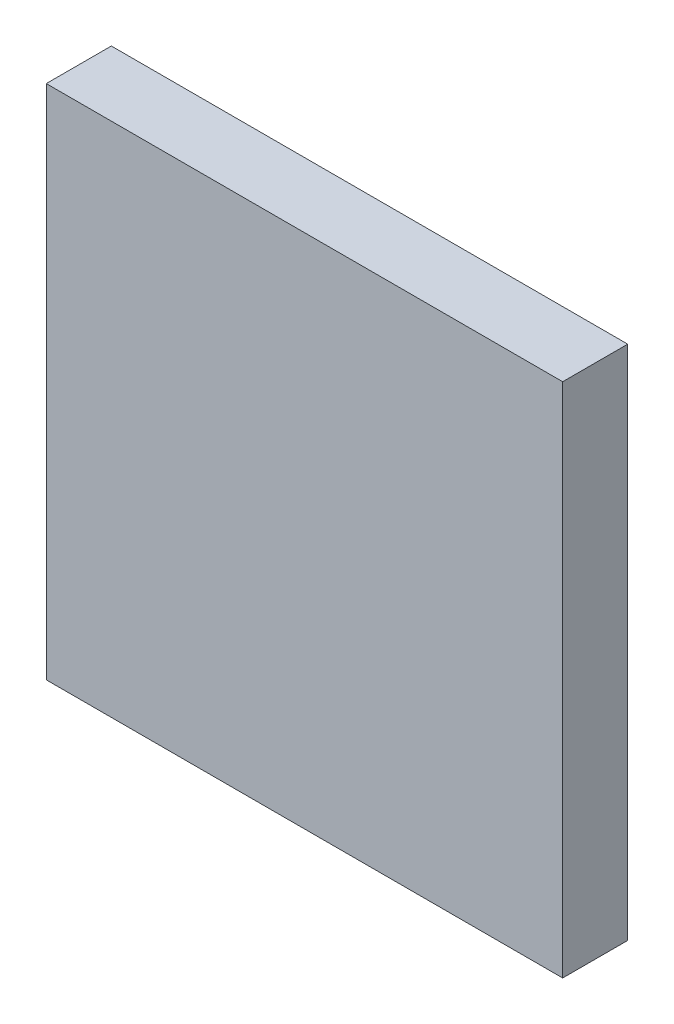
ISO-10303-21;
HEADER;
FILE_DESCRIPTION(('STEP AP214'),'2;1');
FILE_NAME('part.step','',(''),(''),'','','');
FILE_SCHEMA(('AUTOMOTIVE_DESIGN { 1 0 10303 214 1 1 1 1 }'));
ENDSEC;
DATA;
#1=APPLICATION_CONTEXT('core data for automotive mechanical design processes');
#2=APPLICATION_PROTOCOL_DEFINITION('international standard','automotive_design',2000,#1);
#3=PRODUCT_CONTEXT('',#1,'mechanical');
#4=PRODUCT('Part','Part','',(#3));
#5=PRODUCT_RELATED_PRODUCT_CATEGORY('part','',(#4));
#6=PRODUCT_DEFINITION_FORMATION('','',#4);
#7=PRODUCT_DEFINITION_CONTEXT('part definition',#1,'design');
#8=PRODUCT_DEFINITION('design','',#6,#7);
#9=PRODUCT_DEFINITION_SHAPE('','',#8);
#10=(LENGTH_UNIT() NAMED_UNIT(*) SI_UNIT(.MILLI.,.METRE.));
#11=(NAMED_UNIT(*) PLANE_ANGLE_UNIT() SI_UNIT($,.RADIAN.));
#12=(NAMED_UNIT(*) SI_UNIT($,.STERADIAN.) SOLID_ANGLE_UNIT());
#13=UNCERTAINTY_MEASURE_WITH_UNIT(LENGTH_MEASURE(1.E-05),#10,'distance_accuracy_value','');
#14=(GEOMETRIC_REPRESENTATION_CONTEXT(3) GLOBAL_UNCERTAINTY_ASSIGNED_CONTEXT((#13)) GLOBAL_UNIT_ASSIGNED_CONTEXT((#10,
#11,#12)) REPRESENTATION_CONTEXT('',''));
#15=CARTESIAN_POINT('',(0.,0.,0.));
#16=DIRECTION('',(0.,0.,1.));
#17=DIRECTION('',(1.,0.,0.));
#18=AXIS2_PLACEMENT_3D('',#15,#16,#17);
#19=CARTESIAN_POINT('',(-25.4,25.4,3.2004));
#20=DIRECTION('',(1.,0.,0.));
#21=DIRECTION('',(0.,0.,-1.));
#22=AXIS2_PLACEMENT_3D('',#19,#20,#21);
#23=PLANE('',#22);
#24=DIRECTION('',(0.,-1.,0.));
#25=VECTOR('',#24,1.);
#26=CARTESIAN_POINT('',(-25.4,25.4,0.));
#27=LINE('',#26,#25);
#28=CARTESIAN_POINT('',(-25.4,25.4,0.));
#29=VERTEX_POINT('',#28);
#30=CARTESIAN_POINT('',(-25.4,0.,0.));
#31=VERTEX_POINT('',#30);
#32=EDGE_CURVE('E75',#29,#31,#27,.T.);
#33=ORIENTED_EDGE('',*,*,#32,.T.);
#34=DIRECTION('',(0.,0.,-1.));
#35=VECTOR('',#34,1.);
#36=CARTESIAN_POINT('',(-25.4,0.,3.2004));
#37=LINE('',#36,#35);
#38=CARTESIAN_POINT('',(-25.4,0.,3.2004));
#39=VERTEX_POINT('',#38);
#40=EDGE_CURVE('E11',#39,#31,#37,.T.);
#41=ORIENTED_EDGE('',*,*,#40,.F.);
#42=DIRECTION('',(0.,-1.,0.));
#43=VECTOR('',#42,1.);
#44=CARTESIAN_POINT('',(-25.4,25.4,3.2004));
#45=LINE('',#44,#43);
#46=CARTESIAN_POINT('',(-25.4,25.4,3.2004));
#47=VERTEX_POINT('',#46);
#48=EDGE_CURVE('E93',#47,#39,#45,.T.);
#49=ORIENTED_EDGE('',*,*,#48,.F.);
#50=DIRECTION('',(0.,0.,-1.));
#51=VECTOR('',#50,1.);
#52=CARTESIAN_POINT('',(-25.4,25.4,3.2004));
#53=LINE('',#52,#51);
#54=EDGE_CURVE('E87',#47,#29,#53,.T.);
#55=ORIENTED_EDGE('',*,*,#54,.T.);
#56=EDGE_LOOP('',(#33,#41,#49,#55));
#57=FACE_BOUND('',#56,.T.);
#58=ADVANCED_FACE('F31',(#57),#23,.F.);
#59=CARTESIAN_POINT('',(-25.4,0.,3.2004));
#60=DIRECTION('',(0.,1.,0.));
#61=DIRECTION('',(0.,0.,1.));
#62=AXIS2_PLACEMENT_3D('',#59,#60,#61);
#63=PLANE('',#62);
#64=DIRECTION('',(1.,0.,0.));
#65=VECTOR('',#64,1.);
#66=CARTESIAN_POINT('',(-25.4,0.,0.));
#67=LINE('',#66,#65);
#68=CARTESIAN_POINT('',(0.,0.,0.));
#69=VERTEX_POINT('',#68);
#70=EDGE_CURVE('E71',#31,#69,#67,.T.);
#71=ORIENTED_EDGE('',*,*,#70,.T.);
#72=DIRECTION('',(0.,0.,-1.));
#73=VECTOR('',#72,1.);
#74=CARTESIAN_POINT('',(0.,0.,3.2004));
#75=LINE('',#74,#73);
#76=CARTESIAN_POINT('',(0.,0.,3.2004));
#77=VERTEX_POINT('',#76);
#78=EDGE_CURVE('E38',#77,#69,#75,.T.);
#79=ORIENTED_EDGE('',*,*,#78,.F.);
#80=DIRECTION('',(1.,0.,0.));
#81=VECTOR('',#80,1.);
#82=CARTESIAN_POINT('',(-25.4,0.,3.2004));
#83=LINE('',#82,#81);
#84=EDGE_CURVE('E83',#39,#77,#83,.T.);
#85=ORIENTED_EDGE('',*,*,#84,.F.);
#86=ORIENTED_EDGE('',*,*,#40,.T.);
#87=EDGE_LOOP('',(#71,#79,#85,#86));
#88=FACE_BOUND('',#87,.T.);
#89=ADVANCED_FACE('F82',(#88),#63,.F.);
#90=CARTESIAN_POINT('',(0.,25.4,3.2004));
#91=DIRECTION('',(-1.,0.,0.));
#92=DIRECTION('',(0.,-1.,0.));
#93=AXIS2_PLACEMENT_3D('',#90,#91,#92);
#94=PLANE('',#93);
#95=DIRECTION('',(0.,1.,0.));
#96=VECTOR('',#95,1.);
#97=CARTESIAN_POINT('',(0.,25.4,0.));
#98=LINE('',#97,#96);
#99=CARTESIAN_POINT('',(0.,25.4,0.));
#100=VERTEX_POINT('',#99);
#101=EDGE_CURVE('E76',#69,#100,#98,.T.);
#102=ORIENTED_EDGE('',*,*,#101,.T.);
#103=DIRECTION('',(0.,0.,-1.));
#104=VECTOR('',#103,1.);
#105=CARTESIAN_POINT('',(0.,25.4,3.2004));
#106=LINE('',#105,#104);
#107=CARTESIAN_POINT('',(0.,25.4,3.2004));
#108=VERTEX_POINT('',#107);
#109=EDGE_CURVE('E99',#108,#100,#106,.T.);
#110=ORIENTED_EDGE('',*,*,#109,.F.);
#111=DIRECTION('',(0.,1.,0.));
#112=VECTOR('',#111,1.);
#113=CARTESIAN_POINT('',(0.,25.4,3.2004));
#114=LINE('',#113,#112);
#115=EDGE_CURVE('E50',#77,#108,#114,.T.);
#116=ORIENTED_EDGE('',*,*,#115,.F.);
#117=ORIENTED_EDGE('',*,*,#78,.T.);
#118=EDGE_LOOP('',(#102,#110,#116,#117));
#119=FACE_BOUND('',#118,.T.);
#120=ADVANCED_FACE('F102',(#119),#94,.F.);
#121=CARTESIAN_POINT('',(-25.4,25.4,3.2004));
#122=DIRECTION('',(0.,-1.,0.));
#123=DIRECTION('',(1.,0.,0.));
#124=AXIS2_PLACEMENT_3D('',#121,#122,#123);
#125=PLANE('',#124);
#126=DIRECTION('',(-1.,0.,0.));
#127=VECTOR('',#126,1.);
#128=CARTESIAN_POINT('',(-25.4,25.4,0.));
#129=LINE('',#128,#127);
#130=EDGE_CURVE('E91',#100,#29,#129,.T.);
#131=ORIENTED_EDGE('',*,*,#130,.T.);
#132=ORIENTED_EDGE('',*,*,#54,.F.);
#133=DIRECTION('',(-1.,0.,0.));
#134=VECTOR('',#133,1.);
#135=CARTESIAN_POINT('',(-25.4,25.4,3.2004));
#136=LINE('',#135,#134);
#137=EDGE_CURVE('E45',#108,#47,#136,.T.);
#138=ORIENTED_EDGE('',*,*,#137,.F.);
#139=ORIENTED_EDGE('',*,*,#109,.T.);
#140=EDGE_LOOP('',(#131,#132,#138,#139));
#141=FACE_BOUND('',#140,.T.);
#142=ADVANCED_FACE('F104',(#141),#125,.F.);
#143=CARTESIAN_POINT('',(-25.4,0.,3.2004));
#144=DIRECTION('',(0.,0.,1.));
#145=DIRECTION('',(1.,0.,0.));
#146=AXIS2_PLACEMENT_3D('',#143,#144,#145);
#147=PLANE('',#146);
#148=ORIENTED_EDGE('',*,*,#48,.T.);
#149=ORIENTED_EDGE('',*,*,#84,.T.);
#150=ORIENTED_EDGE('',*,*,#115,.T.);
#151=ORIENTED_EDGE('',*,*,#137,.T.);
#152=EDGE_LOOP('',(#148,#149,#150,#151));
#153=FACE_BOUND('',#152,.T.);
#154=ADVANCED_FACE('F105',(#153),#147,.T.);
#155=CARTESIAN_POINT('',(-25.4,0.,0.));
#156=DIRECTION('',(0.,0.,1.));
#157=DIRECTION('',(1.,0.,0.));
#158=AXIS2_PLACEMENT_3D('',#155,#156,#157);
#159=PLANE('',#158);
#160=ORIENTED_EDGE('',*,*,#32,.F.);
#161=ORIENTED_EDGE('',*,*,#130,.F.);
#162=ORIENTED_EDGE('',*,*,#101,.F.);
#163=ORIENTED_EDGE('',*,*,#70,.F.);
#164=EDGE_LOOP('',(#160,#161,#162,#163));
#165=FACE_BOUND('',#164,.T.);
#166=ADVANCED_FACE('F72',(#165),#159,.F.);
#167=CLOSED_SHELL('',(#58,#89,#120,#142,#154,#166));
#168=MANIFOLD_SOLID_BREP('B2',#167);
#169=ADVANCED_BREP_SHAPE_REPRESENTATION('',(#18,#168),#14);
#170=SHAPE_DEFINITION_REPRESENTATION(#9,#169);
ENDSEC;
END-ISO-10303-21;
